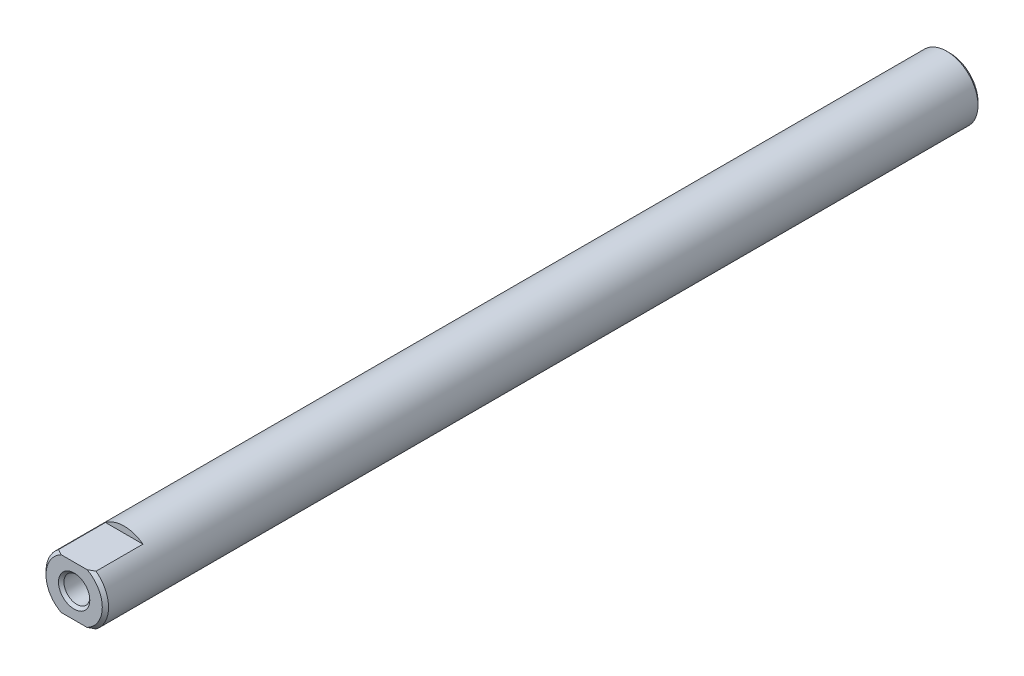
ISO-10303-21;
HEADER;
FILE_DESCRIPTION(('STEP AP214'),'2;1');
FILE_NAME('part.step','',(''),(''),'','','');
FILE_SCHEMA(('AUTOMOTIVE_DESIGN { 1 0 10303 214 1 1 1 1 }'));
ENDSEC;
DATA;
#1=APPLICATION_CONTEXT('core data for automotive mechanical design processes');
#2=APPLICATION_PROTOCOL_DEFINITION('international standard','automotive_design',2000,#1);
#3=PRODUCT_CONTEXT('',#1,'mechanical');
#4=PRODUCT('Part','Part','',(#3));
#5=PRODUCT_RELATED_PRODUCT_CATEGORY('part','',(#4));
#6=PRODUCT_DEFINITION_FORMATION('','',#4);
#7=PRODUCT_DEFINITION_CONTEXT('part definition',#1,'design');
#8=PRODUCT_DEFINITION('design','',#6,#7);
#9=PRODUCT_DEFINITION_SHAPE('','',#8);
#10=(LENGTH_UNIT() NAMED_UNIT(*) SI_UNIT(.MILLI.,.METRE.));
#11=(NAMED_UNIT(*) PLANE_ANGLE_UNIT() SI_UNIT($,.RADIAN.));
#12=(NAMED_UNIT(*) SI_UNIT($,.STERADIAN.) SOLID_ANGLE_UNIT());
#13=UNCERTAINTY_MEASURE_WITH_UNIT(LENGTH_MEASURE(1.E-05),#10,'distance_accuracy_value','');
#14=(GEOMETRIC_REPRESENTATION_CONTEXT(3) GLOBAL_UNCERTAINTY_ASSIGNED_CONTEXT((#13)) GLOBAL_UNIT_ASSIGNED_CONTEXT((#10,
#11,#12)) REPRESENTATION_CONTEXT('',''));
#15=CARTESIAN_POINT('',(0.,0.,0.));
#16=DIRECTION('',(0.,0.,1.));
#17=DIRECTION('',(1.,0.,0.));
#18=AXIS2_PLACEMENT_3D('',#15,#16,#17);
#19=CARTESIAN_POINT('',(0.,0.,-9.99999999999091));
#20=DIRECTION('',(0.,0.,1.));
#21=DIRECTION('',(1.,0.,0.));
#22=AXIS2_PLACEMENT_3D('',#19,#20,#21);
#23=CONICAL_SURFACE('',#22,2.06700000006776,1.04719755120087);
#24=CARTESIAN_POINT('',(5.6843418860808E-11,0.,-11.1933830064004));
#25=VERTEX_POINT('',#24);
#26=VERTEX_LOOP('',#25);
#27=FACE_BOUND('',#26,.T.);
#28=CARTESIAN_POINT('',(0.,0.,-10.));
#29=DIRECTION('',(0.,0.,1.));
#30=DIRECTION('',(1.,0.,0.));
#31=AXIS2_PLACEMENT_3D('',#28,#29,#30);
#32=CIRCLE('',#31,2.067);
#33=CARTESIAN_POINT('',(2.067,0.,-10.));
#34=VERTEX_POINT('',#33);
#35=EDGE_CURVE('E186',#34,#34,#32,.T.);
#36=ORIENTED_EDGE('',*,*,#35,.T.);
#37=EDGE_LOOP('',(#36));
#38=FACE_BOUND('',#37,.T.);
#39=ADVANCED_FACE('F16',(#27,#38),#23,.F.);
#40=CARTESIAN_POINT('',(0.,0.,-11.193383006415));
#41=DIRECTION('',(0.,0.,1.));
#42=DIRECTION('',(1.,0.,0.));
#43=AXIS2_PLACEMENT_3D('',#40,#41,#42);
#44=CYLINDRICAL_SURFACE('',#43,2.067);
#45=CARTESIAN_POINT('',(0.,0.,-0.432999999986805));
#46=DIRECTION('',(0.,0.,1.));
#47=DIRECTION('',(1.,0.,0.));
#48=AXIS2_PLACEMENT_3D('',#45,#46,#47);
#49=CIRCLE('',#48,2.06699999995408);
#50=CARTESIAN_POINT('',(2.06699999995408,0.,-0.432999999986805));
#51=VERTEX_POINT('',#50);
#52=EDGE_CURVE('E183',#51,#51,#49,.T.);
#53=ORIENTED_EDGE('',*,*,#52,.T.);
#54=EDGE_LOOP('',(#53));
#55=FACE_BOUND('',#54,.T.);
#56=ORIENTED_EDGE('',*,*,#35,.F.);
#57=EDGE_LOOP('',(#56));
#58=FACE_BOUND('',#57,.T.);
#59=ADVANCED_FACE('F217',(#55,#58),#44,.F.);
#60=CARTESIAN_POINT('',(0.,0.,0.));
#61=DIRECTION('',(0.,0.,1.));
#62=DIRECTION('',(1.,0.,0.));
#63=AXIS2_PLACEMENT_3D('',#60,#61,#62);
#64=CONICAL_SURFACE('',#63,2.49999999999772,0.785398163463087);
#65=CARTESIAN_POINT('',(0.,0.,0.));
#66=DIRECTION('',(0.,0.,1.));
#67=DIRECTION('',(1.,0.,0.));
#68=AXIS2_PLACEMENT_3D('',#65,#66,#67);
#69=CIRCLE('',#68,2.49999999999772);
#70=CARTESIAN_POINT('',(2.49999999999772,0.,0.));
#71=VERTEX_POINT('',#70);
#72=EDGE_CURVE('E19',#71,#71,#69,.T.);
#73=ORIENTED_EDGE('',*,*,#72,.T.);
#74=EDGE_LOOP('',(#73));
#75=FACE_BOUND('',#74,.T.);
#76=ORIENTED_EDGE('',*,*,#52,.F.);
#77=EDGE_LOOP('',(#76));
#78=FACE_BOUND('',#77,.T.);
#79=ADVANCED_FACE('F214',(#75,#78),#64,.F.);
#80=CARTESIAN_POINT('',(-4.5,0.,-140.));
#81=DIRECTION('',(0.,0.,1.));
#82=DIRECTION('',(1.,0.,0.));
#83=AXIS2_PLACEMENT_3D('',#80,#81,#82);
#84=PLANE('',#83);
#85=CARTESIAN_POINT('',(0.,0.,-140.000000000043));
#86=DIRECTION('',(0.,0.,1.));
#87=DIRECTION('',(1.,0.,0.));
#88=AXIS2_PLACEMENT_3D('',#85,#86,#87);
#89=CIRCLE('',#88,4.49999999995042);
#90=CARTESIAN_POINT('',(4.49999999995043,0.,-140.000000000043));
#91=VERTEX_POINT('',#90);
#92=EDGE_CURVE('E85',#91,#91,#89,.T.);
#93=ORIENTED_EDGE('',*,*,#92,.F.);
#94=EDGE_LOOP('',(#93));
#95=FACE_BOUND('',#94,.T.);
#96=ADVANCED_FACE('F207',(#95),#84,.F.);
#97=CARTESIAN_POINT('',(0.,0.,0.));
#98=DIRECTION('',(0.,0.,-1.));
#99=DIRECTION('',(-1.,0.,0.));
#100=AXIS2_PLACEMENT_3D('',#97,#98,#99);
#101=PLANE('',#100);
#102=ORIENTED_EDGE('',*,*,#72,.F.);
#103=EDGE_LOOP('',(#102));
#104=FACE_BOUND('',#103,.T.);
#105=DIRECTION('',(1.,0.,0.));
#106=VECTOR('',#105,1.);
#107=CARTESIAN_POINT('',(-3.,-4.,0.));
#108=LINE('',#107,#106);
#109=CARTESIAN_POINT('',(2.06155281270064,-4.,0.));
#110=VERTEX_POINT('',#109);
#111=CARTESIAN_POINT('',(-2.06155281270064,-4.,0.));
#112=VERTEX_POINT('',#111);
#113=EDGE_CURVE('E88',#110,#112,#108,.F.);
#114=ORIENTED_EDGE('',*,*,#113,.F.);
#115=CARTESIAN_POINT('',(0.,0.,0.));
#116=DIRECTION('',(0.,0.,-1.));
#117=DIRECTION('',(-1.,0.,0.));
#118=AXIS2_PLACEMENT_3D('',#115,#116,#117);
#119=CIRCLE('',#118,4.49999999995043);
#120=CARTESIAN_POINT('',(2.06155281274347,4.,-1.96240373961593E-11));
#121=VERTEX_POINT('',#120);
#122=EDGE_CURVE('E58',#121,#110,#119,.T.);
#123=ORIENTED_EDGE('',*,*,#122,.F.);
#124=DIRECTION('',(1.,0.,0.));
#125=VECTOR('',#124,1.);
#126=CARTESIAN_POINT('',(3.,4.,0.));
#127=LINE('',#126,#125);
#128=CARTESIAN_POINT('',(-2.06155281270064,4.,0.));
#129=VERTEX_POINT('',#128);
#130=EDGE_CURVE('E132',#129,#121,#127,.T.);
#131=ORIENTED_EDGE('',*,*,#130,.F.);
#132=CARTESIAN_POINT('',(0.,0.,0.));
#133=DIRECTION('',(0.,0.,-1.));
#134=DIRECTION('',(-1.,0.,0.));
#135=AXIS2_PLACEMENT_3D('',#132,#133,#134);
#136=CIRCLE('',#135,4.49999999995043);
#137=EDGE_CURVE('E90',#112,#129,#136,.T.);
#138=ORIENTED_EDGE('',*,*,#137,.F.);
#139=EDGE_LOOP('',(#114,#123,#131,#138));
#140=FACE_BOUND('',#139,.T.);
#141=ADVANCED_FACE('F89',(#104,#140),#101,.F.);
#142=CARTESIAN_POINT('',(0.,0.,-139.500000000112));
#143=DIRECTION('',(0.,0.,1.));
#144=DIRECTION('',(1.,0.,0.));
#145=AXIS2_PLACEMENT_3D('',#142,#143,#144);
#146=CONICAL_SURFACE('',#145,4.99999999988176,0.785398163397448);
#147=CARTESIAN_POINT('',(0.,0.,-139.5));
#148=DIRECTION('',(0.,0.,1.));
#149=DIRECTION('',(1.,0.,0.));
#150=AXIS2_PLACEMENT_3D('',#147,#148,#149);
#151=CIRCLE('',#150,5.);
#152=CARTESIAN_POINT('',(5.00000000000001,0.,-139.5));
#153=VERTEX_POINT('',#152);
#154=EDGE_CURVE('E164',#153,#153,#151,.T.);
#155=ORIENTED_EDGE('',*,*,#154,.F.);
#156=EDGE_LOOP('',(#155));
#157=FACE_BOUND('',#156,.T.);
#158=ORIENTED_EDGE('',*,*,#92,.T.);
#159=EDGE_LOOP('',(#158));
#160=FACE_BOUND('',#159,.T.);
#161=ADVANCED_FACE('F198',(#157,#160),#146,.T.);
#162=CARTESIAN_POINT('',(0.,0.,-8.));
#163=DIRECTION('',(0.,0.,1.));
#164=DIRECTION('',(1.,0.,0.));
#165=AXIS2_PLACEMENT_3D('',#162,#163,#164);
#166=PLANE('',#165);
#167=CARTESIAN_POINT('',(0.,0.,-8.));
#168=DIRECTION('',(0.,0.,1.));
#169=DIRECTION('',(1.,0.,0.));
#170=AXIS2_PLACEMENT_3D('',#167,#168,#169);
#171=CIRCLE('',#170,5.);
#172=CARTESIAN_POINT('',(-3.,4.,-8.));
#173=VERTEX_POINT('',#172);
#174=CARTESIAN_POINT('',(3.,4.,-8.));
#175=VERTEX_POINT('',#174);
#176=EDGE_CURVE('E66',#173,#175,#171,.F.);
#177=ORIENTED_EDGE('',*,*,#176,.F.);
#178=DIRECTION('',(1.,0.,0.));
#179=VECTOR('',#178,1.);
#180=CARTESIAN_POINT('',(3.,4.,-8.));
#181=LINE('',#180,#179);
#182=EDGE_CURVE('E131',#175,#173,#181,.F.);
#183=ORIENTED_EDGE('',*,*,#182,.F.);
#184=EDGE_LOOP('',(#177,#183));
#185=FACE_BOUND('',#184,.T.);
#186=ADVANCED_FACE('F120',(#185),#166,.T.);
#187=CARTESIAN_POINT('',(0.,0.,-0.499999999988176));
#188=DIRECTION('',(0.,0.,-1.));
#189=DIRECTION('',(-1.,0.,0.));
#190=AXIS2_PLACEMENT_3D('',#187,#188,#189);
#191=CONICAL_SURFACE('',#190,4.99999999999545,0.785398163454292);
#192=CARTESIAN_POINT('',(3.00000000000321,-4.,-0.49999999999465));
#193=CARTESIAN_POINT('',(2.92395437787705,-4.,-0.454379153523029));
#194=CARTESIAN_POINT('',(2.84741921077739,-4.,-0.4095619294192));
#195=CARTESIAN_POINT('',(2.69334289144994,-4.,-0.321832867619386));
#196=CARTESIAN_POINT('',(2.61580254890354,-4.,-0.278919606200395));
#197=CARTESIAN_POINT('',(2.45956360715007,-4.,-0.195221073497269));
#198=CARTESIAN_POINT('',(2.38086486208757,-4.,-0.154436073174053));
#199=CARTESIAN_POINT('',(2.22218014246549,-4.,-0.0752997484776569));
#200=CARTESIAN_POINT('',(2.14219323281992,-4.,-0.0369503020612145));
#201=CARTESIAN_POINT('',(2.06155281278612,-4.,-3.91621495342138E-11));
#202=B_SPLINE_CURVE_WITH_KNOTS('',3,(#192,#193,#194,#195,#196,#197,#198,#199,#200,#201),
.UNSPECIFIED.,.F.,.F.,(4,2,2,2,4),(0.,0.266045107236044,0.531887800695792,0.797764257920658,
1.06384329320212),.UNSPECIFIED.);
#203=CARTESIAN_POINT('',(3.0000000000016,-4.,-0.499999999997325));
#204=VERTEX_POINT('',#203);
#205=EDGE_CURVE('E80',#204,#110,#202,.T.);
#206=ORIENTED_EDGE('',*,*,#205,.F.);
#207=CARTESIAN_POINT('',(0.,0.,-0.5));
#208=DIRECTION('',(0.,0.,1.));
#209=DIRECTION('',(1.,0.,0.));
#210=AXIS2_PLACEMENT_3D('',#207,#208,#209);
#211=CIRCLE('',#210,5.);
#212=CARTESIAN_POINT('',(3.0000000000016,4.,-0.499999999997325));
#213=VERTEX_POINT('',#212);
#214=EDGE_CURVE('E179',#213,#204,#211,.F.);
#215=ORIENTED_EDGE('',*,*,#214,.F.);
#216=CARTESIAN_POINT('',(2.06155281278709,4.00000000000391,-3.75524856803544E-11));
#217=CARTESIAN_POINT('',(2.14219323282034,4.00000000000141,-0.0369503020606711));
#218=CARTESIAN_POINT('',(2.22218014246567,4.00000000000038,-0.0752997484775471));
#219=CARTESIAN_POINT('',(2.38086486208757,3.99999999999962,-0.154436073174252));
#220=CARTESIAN_POINT('',(2.4595636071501,3.99999999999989,-0.195221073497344));
#221=CARTESIAN_POINT('',(2.6158025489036,4.00000000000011,-0.278919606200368));
#222=CARTESIAN_POINT('',(2.69334289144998,4.00000000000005,-0.321832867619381));
#223=CARTESIAN_POINT('',(2.8474192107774,3.99999999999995,-0.409561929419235));
#224=CARTESIAN_POINT('',(2.92395437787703,3.99999999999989,-0.454379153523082));
#225=CARTESIAN_POINT('',(3.00000000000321,4.,-0.49999999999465));
#226=B_SPLINE_CURVE_WITH_KNOTS('',3,(#216,#217,#218,#219,#220,#221,#222,#223,#224,#225),
.UNSPECIFIED.,.F.,.F.,(4,2,2,2,4),(0.,0.266079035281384,0.5319554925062,0.797798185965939,
1.06384329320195),.UNSPECIFIED.);
#227=EDGE_CURVE('E83',#121,#213,#226,.T.);
#228=ORIENTED_EDGE('',*,*,#227,.F.);
#229=ORIENTED_EDGE('',*,*,#122,.T.);
#230=EDGE_LOOP('',(#206,#215,#228,#229));
#231=FACE_BOUND('',#230,.T.);
#232=ADVANCED_FACE('F77',(#231),#191,.T.);
#233=CARTESIAN_POINT('',(0.,0.,-8.));
#234=DIRECTION('',(0.,0.,1.));
#235=DIRECTION('',(1.,0.,0.));
#236=AXIS2_PLACEMENT_3D('',#233,#234,#235);
#237=PLANE('',#236);
#238=CARTESIAN_POINT('',(0.,0.,-8.));
#239=DIRECTION('',(0.,0.,1.));
#240=DIRECTION('',(1.,0.,0.));
#241=AXIS2_PLACEMENT_3D('',#238,#239,#240);
#242=CIRCLE('',#241,5.);
#243=CARTESIAN_POINT('',(3.,-4.,-8.));
#244=VERTEX_POINT('',#243);
#245=CARTESIAN_POINT('',(-3.,-4.,-8.));
#246=VERTEX_POINT('',#245);
#247=EDGE_CURVE('E175',#244,#246,#242,.F.);
#248=ORIENTED_EDGE('',*,*,#247,.F.);
#249=DIRECTION('',(1.,0.,0.));
#250=VECTOR('',#249,1.);
#251=CARTESIAN_POINT('',(-3.,-4.,-8.));
#252=LINE('',#251,#250);
#253=EDGE_CURVE('E93',#246,#244,#252,.T.);
#254=ORIENTED_EDGE('',*,*,#253,.F.);
#255=EDGE_LOOP('',(#248,#254));
#256=FACE_BOUND('',#255,.T.);
#257=ADVANCED_FACE('F119',(#256),#237,.T.);
#258=CARTESIAN_POINT('',(-3.,-4.,-8.));
#259=DIRECTION('',(0.,-1.,0.));
#260=DIRECTION('',(0.,0.,-1.));
#261=AXIS2_PLACEMENT_3D('',#258,#259,#260);
#262=PLANE('',#261);
#263=ORIENTED_EDGE('',*,*,#253,.T.);
#264=DIRECTION('',(0.,0.,1.));
#265=VECTOR('',#264,1.);
#266=CARTESIAN_POINT('',(3.,-4.,-140.));
#267=LINE('',#266,#265);
#268=EDGE_CURVE('E97',#204,#244,#267,.F.);
#269=ORIENTED_EDGE('',*,*,#268,.F.);
#270=ORIENTED_EDGE('',*,*,#205,.T.);
#271=ORIENTED_EDGE('',*,*,#113,.T.);
#272=CARTESIAN_POINT('',(-3.00000000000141,-4.,-0.499999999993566));
#273=CARTESIAN_POINT('',(-2.9239543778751,-4.,-0.454379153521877));
#274=CARTESIAN_POINT('',(-2.8474192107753,-4.,-0.409561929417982));
#275=CARTESIAN_POINT('',(-2.69334289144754,-4.,-0.321832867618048));
#276=CARTESIAN_POINT('',(-2.615802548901,-4.,-0.278919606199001));
#277=CARTESIAN_POINT('',(-2.45956360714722,-4.,-0.195221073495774));
#278=CARTESIAN_POINT('',(-2.38086486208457,-4.,-0.154436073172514));
#279=CARTESIAN_POINT('',(-2.22218014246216,-4.,-0.0752997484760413));
#280=CARTESIAN_POINT('',(-2.14219323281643,-4.,-0.0369503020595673));
#281=CARTESIAN_POINT('',(-2.06155281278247,-4.,-3.74909255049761E-11));
#282=B_SPLINE_CURVE_WITH_KNOTS('',3,(#272,#273,#274,#275,#276,#277,#278,#279,#280,#281),
.UNSPECIFIED.,.F.,.F.,(4,2,2,2,4),(0.,0.266045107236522,0.531887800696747,0.797764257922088,
1.06384329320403),.UNSPECIFIED.);
#283=CARTESIAN_POINT('',(-3.00000000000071,-4.,-0.499999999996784));
#284=VERTEX_POINT('',#283);
#285=EDGE_CURVE('E107',#284,#112,#282,.T.);
#286=ORIENTED_EDGE('',*,*,#285,.F.);
#287=DIRECTION('',(0.,0.,1.));
#288=VECTOR('',#287,1.);
#289=CARTESIAN_POINT('',(-3.,-4.,-140.));
#290=LINE('',#289,#288);
#291=EDGE_CURVE('E173',#246,#284,#290,.T.);
#292=ORIENTED_EDGE('',*,*,#291,.F.);
#293=EDGE_LOOP('',(#263,#269,#270,#271,#286,#292));
#294=FACE_BOUND('',#293,.T.);
#295=ADVANCED_FACE('F95',(#294),#262,.T.);
#296=CARTESIAN_POINT('',(0.,0.,-0.499999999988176));
#297=DIRECTION('',(0.,0.,-1.));
#298=DIRECTION('',(-1.,0.,0.));
#299=AXIS2_PLACEMENT_3D('',#296,#297,#298);
#300=CONICAL_SURFACE('',#299,4.99999999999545,0.785398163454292);
#301=CARTESIAN_POINT('',(-3.00000000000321,4.,-0.49999999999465));
#302=CARTESIAN_POINT('',(-2.92395437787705,4.,-0.454379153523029));
#303=CARTESIAN_POINT('',(-2.84741921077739,4.,-0.4095619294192));
#304=CARTESIAN_POINT('',(-2.69334289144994,4.,-0.321832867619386));
#305=CARTESIAN_POINT('',(-2.61580254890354,4.,-0.278919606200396));
#306=CARTESIAN_POINT('',(-2.45956360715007,4.,-0.19522107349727));
#307=CARTESIAN_POINT('',(-2.38086486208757,4.,-0.154436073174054));
#308=CARTESIAN_POINT('',(-2.22218014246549,4.,-0.0752997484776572));
#309=CARTESIAN_POINT('',(-2.14219323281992,4.,-0.0369503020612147));
#310=CARTESIAN_POINT('',(-2.06155281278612,4.,-3.91623316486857E-11));
#311=B_SPLINE_CURVE_WITH_KNOTS('',3,(#301,#302,#303,#304,#305,#306,#307,#308,#309,#310),
.UNSPECIFIED.,.F.,.F.,(4,2,2,2,4),(0.,0.266045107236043,0.531887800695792,0.797764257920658,
1.06384329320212),.UNSPECIFIED.);
#312=CARTESIAN_POINT('',(-3.0000000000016,4.,-0.499999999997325));
#313=VERTEX_POINT('',#312);
#314=EDGE_CURVE('E34',#313,#129,#311,.T.);
#315=ORIENTED_EDGE('',*,*,#314,.F.);
#316=CARTESIAN_POINT('',(0.,0.,-0.5));
#317=DIRECTION('',(0.,0.,1.));
#318=DIRECTION('',(1.,0.,0.));
#319=AXIS2_PLACEMENT_3D('',#316,#317,#318);
#320=CIRCLE('',#319,5.);
#321=EDGE_CURVE('E25',#284,#313,#320,.F.);
#322=ORIENTED_EDGE('',*,*,#321,.F.);
#323=ORIENTED_EDGE('',*,*,#285,.T.);
#324=ORIENTED_EDGE('',*,*,#137,.T.);
#325=EDGE_LOOP('',(#315,#322,#323,#324));
#326=FACE_BOUND('',#325,.T.);
#327=ADVANCED_FACE('F143',(#326),#300,.T.);
#328=CARTESIAN_POINT('',(3.,4.,-8.));
#329=DIRECTION('',(0.,1.,0.));
#330=DIRECTION('',(0.,0.,1.));
#331=AXIS2_PLACEMENT_3D('',#328,#329,#330);
#332=PLANE('',#331);
#333=ORIENTED_EDGE('',*,*,#182,.T.);
#334=DIRECTION('',(0.,0.,1.));
#335=VECTOR('',#334,1.);
#336=CARTESIAN_POINT('',(-3.,4.,-140.));
#337=LINE('',#336,#335);
#338=EDGE_CURVE('E11',#313,#173,#337,.F.);
#339=ORIENTED_EDGE('',*,*,#338,.F.);
#340=ORIENTED_EDGE('',*,*,#314,.T.);
#341=ORIENTED_EDGE('',*,*,#130,.T.);
#342=ORIENTED_EDGE('',*,*,#227,.T.);
#343=DIRECTION('',(0.,0.,1.));
#344=VECTOR('',#343,1.);
#345=CARTESIAN_POINT('',(3.,4.,-140.));
#346=LINE('',#345,#344);
#347=EDGE_CURVE('E167',#175,#213,#346,.T.);
#348=ORIENTED_EDGE('',*,*,#347,.F.);
#349=EDGE_LOOP('',(#333,#339,#340,#341,#342,#348));
#350=FACE_BOUND('',#349,.T.);
#351=ADVANCED_FACE('F138',(#350),#332,.T.);
#352=CARTESIAN_POINT('',(0.,0.,-140.));
#353=DIRECTION('',(0.,0.,1.));
#354=DIRECTION('',(1.,0.,0.));
#355=AXIS2_PLACEMENT_3D('',#352,#353,#354);
#356=CYLINDRICAL_SURFACE('',#355,5.);
#357=ORIENTED_EDGE('',*,*,#321,.T.);
#358=ORIENTED_EDGE('',*,*,#338,.T.);
#359=ORIENTED_EDGE('',*,*,#176,.T.);
#360=ORIENTED_EDGE('',*,*,#347,.T.);
#361=ORIENTED_EDGE('',*,*,#214,.T.);
#362=ORIENTED_EDGE('',*,*,#268,.T.);
#363=ORIENTED_EDGE('',*,*,#247,.T.);
#364=ORIENTED_EDGE('',*,*,#291,.T.);
#365=EDGE_LOOP('',(#357,#358,#359,#360,#361,#362,#363,#364));
#366=FACE_BOUND('',#365,.T.);
#367=ORIENTED_EDGE('',*,*,#154,.T.);
#368=EDGE_LOOP('',(#367));
#369=FACE_BOUND('',#368,.T.);
#370=ADVANCED_FACE('F142',(#366,#369),#356,.T.);
#371=CLOSED_SHELL('',(#39,#59,#79,#96,#141,#161,#186,#232,#257,#295,#327,#351,#370));
#372=MANIFOLD_SOLID_BREP('B1',#371);
#373=ADVANCED_BREP_SHAPE_REPRESENTATION('',(#18,#372),#14);
#374=SHAPE_DEFINITION_REPRESENTATION(#9,#373);
ENDSEC;
END-ISO-10303-21;
